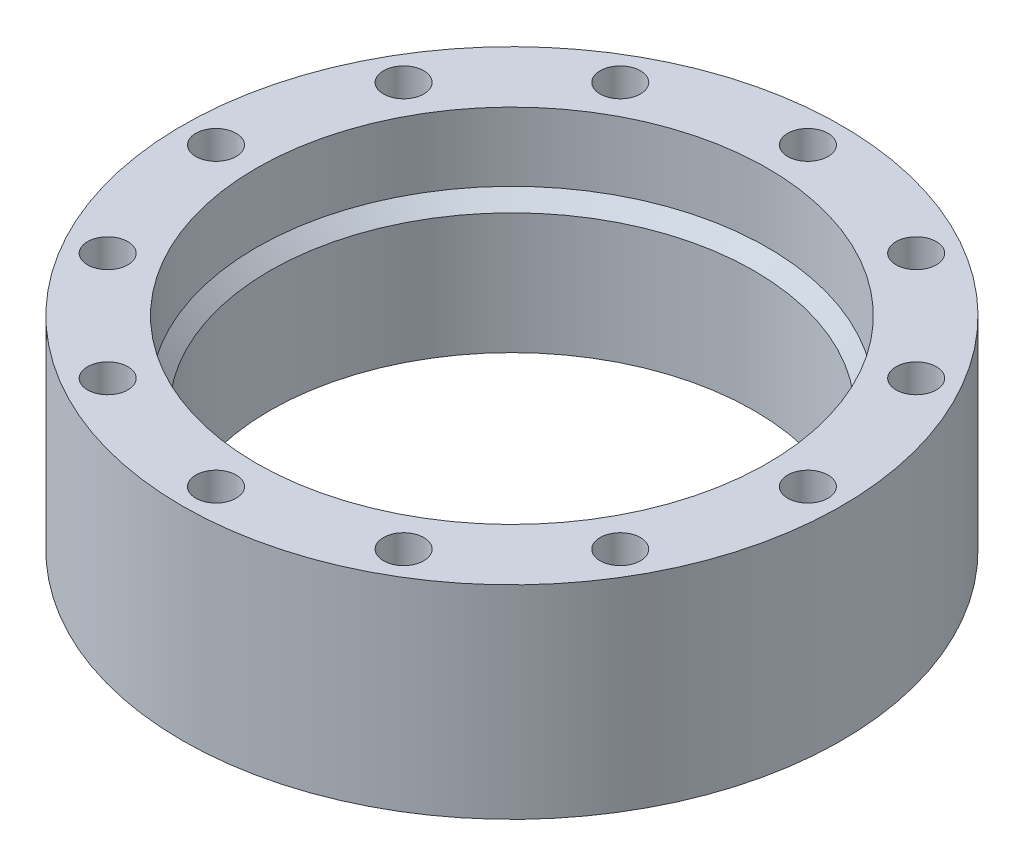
from build123d import *

# Parameters (mm, degrees)
SKETCH1_R           = 24.5
SKETCH1_R_2         = 19
BOSS_EXTRUDE1_DEPTH = 15.1
SKETCH2_R           = 1.5
CUT_EXTRUDE1_DEPTH  = 5


with BuildPart() as part:
    # Sketch1 → Boss-Extrude1 (new body)
    with BuildSketch(Plane(origin=(0, 0, 0), x_dir=(1, 0, 0), z_dir=(0, 1, 0))):
        with Locations(Location((0, 0, 0), (0, 0, 270))):
            Circle(SKETCH1_R)
        with Locations(Location((0, 0, 0), (0, 0, 270))):
            Circle(SKETCH1_R_2, mode=Mode.SUBTRACT)
    extrude(amount=BOSS_EXTRUDE1_DEPTH)

    # Sketch2 → Cut-Extrude1 (cut)
    with BuildSketch(Plane(origin=(0, 15.1, 0), x_dir=(1, 0, 0), z_dir=(0, 1, 0))):
        with Locations(Location((0, 22, 0), (0, 0, 270))):
            Circle(SKETCH2_R)
        with Locations(Location((11, 19.052558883, 0), (0, 0, 270))):
            Circle(SKETCH2_R)
        with Locations(Location((19.052558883, 11, 0), (0, 0, 270))):
            Circle(SKETCH2_R)
        with Locations(Location((22, 0, 0), (0, 0, 270))):
            Circle(SKETCH2_R)
        with Locations(Location((19.052558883, -11, 0), (0, 0, 270))):
            Circle(SKETCH2_R)
        with Locations(Location((11, -19.052558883, 0), (0, 0, 270))):
            Circle(SKETCH2_R)
        with Locations(Location((0, -22, 0), (0, 0, 270))):
            Circle(SKETCH2_R)
        with Locations(Location((-11, -19.052558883, 0), (0, 0, 270))):
            Circle(SKETCH2_R)
        with Locations(Location((-19.052558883, -11, 0), (0, 0, 270))):
            Circle(SKETCH2_R)
        with Locations(Location((-22, 0, 0), (0, 0, 270))):
            Circle(SKETCH2_R)
        with Locations(Location((-19.052558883, 11, 0), (0, 0, 270))):
            Circle(SKETCH2_R)
        with Locations(Location((-11, 19.052558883, 0), (0, 0, 270))):
            Circle(SKETCH2_R)
    extrude(amount=-CUT_EXTRUDE1_DEPTH, mode=Mode.SUBTRACT)

    # Sketch3 → Revolve1 (revolve)
    with BuildSketch(Plane.XY, mode=Mode.PRIVATE) as revolve1_sk:
        Polygon((18, 0), (18, 9), (19, 10), (19, 0), align=None)
    revolve(revolve1_sk.sketch.rotate(Axis((0, 0, 0), (0, 1, 0)), 180), axis=Axis((0, 0, 0), (0, 1, 0)))


solid = part.part
